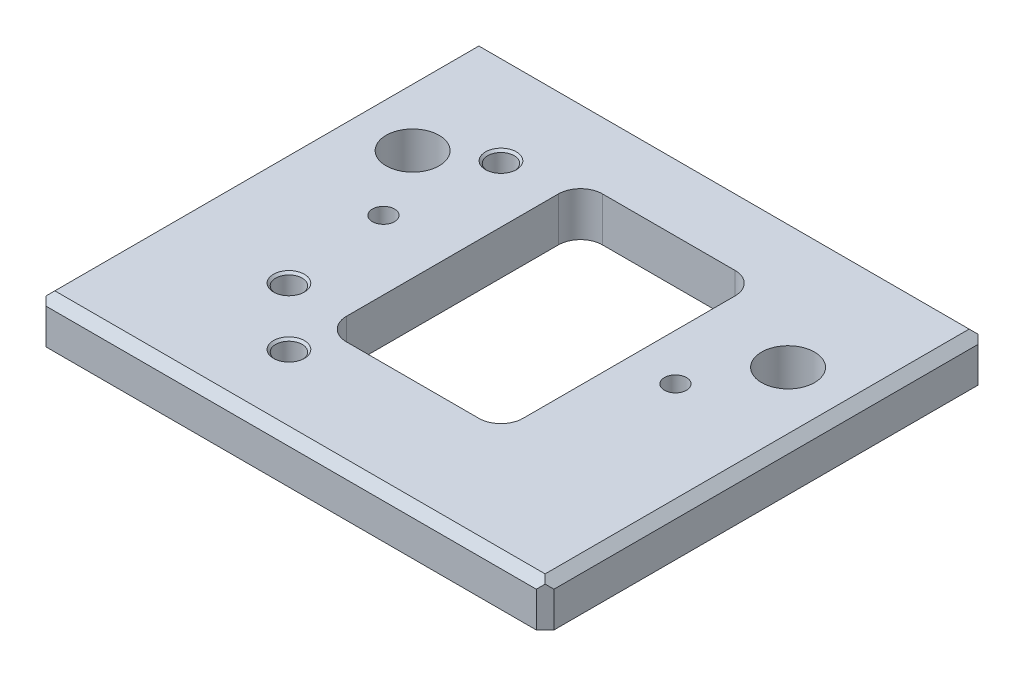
ISO-10303-21;
HEADER;
FILE_DESCRIPTION(('STEP AP214'),'2;1');
FILE_NAME('part.step','',(''),(''),'','','');
FILE_SCHEMA(('AUTOMOTIVE_DESIGN { 1 0 10303 214 1 1 1 1 }'));
ENDSEC;
DATA;
#1=APPLICATION_CONTEXT('core data for automotive mechanical design processes');
#2=APPLICATION_PROTOCOL_DEFINITION('international standard','automotive_design',2000,#1);
#3=PRODUCT_CONTEXT('',#1,'mechanical');
#4=PRODUCT('Part','Part','',(#3));
#5=PRODUCT_RELATED_PRODUCT_CATEGORY('part','',(#4));
#6=PRODUCT_DEFINITION_FORMATION('','',#4);
#7=PRODUCT_DEFINITION_CONTEXT('part definition',#1,'design');
#8=PRODUCT_DEFINITION('design','',#6,#7);
#9=PRODUCT_DEFINITION_SHAPE('','',#8);
#10=(LENGTH_UNIT() NAMED_UNIT(*) SI_UNIT(.MILLI.,.METRE.));
#11=(NAMED_UNIT(*) PLANE_ANGLE_UNIT() SI_UNIT($,.RADIAN.));
#12=(NAMED_UNIT(*) SI_UNIT($,.STERADIAN.) SOLID_ANGLE_UNIT());
#13=UNCERTAINTY_MEASURE_WITH_UNIT(LENGTH_MEASURE(1.E-05),#10,'distance_accuracy_value','');
#14=(GEOMETRIC_REPRESENTATION_CONTEXT(3) GLOBAL_UNCERTAINTY_ASSIGNED_CONTEXT((#13)) GLOBAL_UNIT_ASSIGNED_CONTEXT((#10,
#11,#12)) REPRESENTATION_CONTEXT('',''));
#15=CARTESIAN_POINT('',(0.,0.,0.));
#16=DIRECTION('',(0.,0.,1.));
#17=DIRECTION('',(1.,0.,0.));
#18=AXIS2_PLACEMENT_3D('',#15,#16,#17);
#19=CARTESIAN_POINT('',(0.,0.,0.));
#20=DIRECTION('',(0.,-1.,0.));
#21=DIRECTION('',(0.,0.,-1.));
#22=AXIS2_PLACEMENT_3D('',#19,#20,#21);
#23=PLANE('',#22);
#24=CARTESIAN_POINT('',(70.,0.,-50.));
#25=DIRECTION('',(0.,1.,0.));
#26=DIRECTION('',(0.,0.,1.));
#27=AXIS2_PLACEMENT_3D('',#24,#25,#26);
#28=CIRCLE('',#27,6.);
#29=CARTESIAN_POINT('',(70.,0.,-44.));
#30=VERTEX_POINT('',#29);
#31=EDGE_CURVE('E485',#30,#30,#28,.T.);
#32=ORIENTED_EDGE('',*,*,#31,.F.);
#33=EDGE_LOOP('',(#32));
#34=FACE_BOUND('',#33,.T.);
#35=CARTESIAN_POINT('',(-15.,0.,-50.));
#36=DIRECTION('',(0.,1.,0.));
#37=DIRECTION('',(0.,0.,1.));
#38=AXIS2_PLACEMENT_3D('',#35,#36,#37);
#39=CIRCLE('',#38,6.);
#40=CARTESIAN_POINT('',(-15.,0.,-44.));
#41=VERTEX_POINT('',#40);
#42=EDGE_CURVE('E479',#41,#41,#39,.T.);
#43=ORIENTED_EDGE('',*,*,#42,.F.);
#44=EDGE_LOOP('',(#43));
#45=FACE_BOUND('',#44,.T.);
#46=CARTESIAN_POINT('',(60.5,0.,-34.));
#47=DIRECTION('',(0.,1.,0.));
#48=DIRECTION('',(0.,0.,1.));
#49=AXIS2_PLACEMENT_3D('',#46,#47,#48);
#50=CIRCLE('',#49,2.49999999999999);
#51=CARTESIAN_POINT('',(60.5,0.,-31.5));
#52=VERTEX_POINT('',#51);
#53=EDGE_CURVE('E474',#52,#52,#50,.T.);
#54=ORIENTED_EDGE('',*,*,#53,.F.);
#55=EDGE_LOOP('',(#54));
#56=FACE_BOUND('',#55,.T.);
#57=DIRECTION('',(-1.,0.,0.));
#58=VECTOR('',#57,1.);
#59=CARTESIAN_POINT('',(15.,0.,-63.));
#60=LINE('',#59,#58);
#61=CARTESIAN_POINT('',(45.,0.,-63.));
#62=VERTEX_POINT('',#61);
#63=CARTESIAN_POINT('',(15.,0.,-63.));
#64=VERTEX_POINT('',#63);
#65=EDGE_CURVE('E224',#62,#64,#60,.T.);
#66=ORIENTED_EDGE('',*,*,#65,.F.);
#67=CARTESIAN_POINT('',(45.,0.,-58.));
#68=DIRECTION('',(0.,1.,0.));
#69=DIRECTION('',(0.,0.,-1.));
#70=AXIS2_PLACEMENT_3D('',#67,#68,#69);
#71=CIRCLE('',#70,4.99999999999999);
#72=CARTESIAN_POINT('',(50.,0.,-58.));
#73=VERTEX_POINT('',#72);
#74=EDGE_CURVE('E182',#73,#62,#71,.T.);
#75=ORIENTED_EDGE('',*,*,#74,.F.);
#76=DIRECTION('',(0.,0.,-1.));
#77=VECTOR('',#76,1.);
#78=CARTESIAN_POINT('',(50.,0.,-10.));
#79=LINE('',#78,#77);
#80=CARTESIAN_POINT('',(50.,0.,-10.));
#81=VERTEX_POINT('',#80);
#82=EDGE_CURVE('E201',#81,#73,#79,.T.);
#83=ORIENTED_EDGE('',*,*,#82,.F.);
#84=CARTESIAN_POINT('',(45.,0.,-10.));
#85=DIRECTION('',(0.,1.,0.));
#86=DIRECTION('',(0.,0.,1.));
#87=AXIS2_PLACEMENT_3D('',#84,#85,#86);
#88=CIRCLE('',#87,5.);
#89=CARTESIAN_POINT('',(45.,0.,-5.));
#90=VERTEX_POINT('',#89);
#91=EDGE_CURVE('E204',#90,#81,#88,.T.);
#92=ORIENTED_EDGE('',*,*,#91,.F.);
#93=DIRECTION('',(1.,0.,0.));
#94=VECTOR('',#93,1.);
#95=CARTESIAN_POINT('',(15.,0.,-5.));
#96=LINE('',#95,#94);
#97=CARTESIAN_POINT('',(15.,0.,-5.));
#98=VERTEX_POINT('',#97);
#99=EDGE_CURVE('E236',#98,#90,#96,.T.);
#100=ORIENTED_EDGE('',*,*,#99,.F.);
#101=CARTESIAN_POINT('',(15.,0.,-10.));
#102=DIRECTION('',(0.,1.,0.));
#103=DIRECTION('',(0.,0.,-1.));
#104=AXIS2_PLACEMENT_3D('',#101,#102,#103);
#105=CIRCLE('',#104,5.);
#106=CARTESIAN_POINT('',(10.,0.,-10.));
#107=VERTEX_POINT('',#106);
#108=EDGE_CURVE('E233',#107,#98,#105,.T.);
#109=ORIENTED_EDGE('',*,*,#108,.F.);
#110=DIRECTION('',(0.,0.,1.));
#111=VECTOR('',#110,1.);
#112=CARTESIAN_POINT('',(10.,0.,-10.));
#113=LINE('',#112,#111);
#114=CARTESIAN_POINT('',(10.,0.,-58.));
#115=VERTEX_POINT('',#114);
#116=EDGE_CURVE('E230',#115,#107,#113,.T.);
#117=ORIENTED_EDGE('',*,*,#116,.F.);
#118=CARTESIAN_POINT('',(15.,0.,-58.));
#119=DIRECTION('',(0.,1.,0.));
#120=DIRECTION('',(0.,0.,-1.));
#121=AXIS2_PLACEMENT_3D('',#118,#119,#120);
#122=CIRCLE('',#121,5.);
#123=EDGE_CURVE('E227',#64,#115,#122,.T.);
#124=ORIENTED_EDGE('',*,*,#123,.F.);
#125=EDGE_LOOP('',(#66,#75,#83,#92,#100,#109,#117,#124));
#126=FACE_BOUND('',#125,.T.);
#127=DIRECTION('',(1.,0.,0.));
#128=VECTOR('',#127,1.);
#129=CARTESIAN_POINT('',(83.,0.,18.));
#130=LINE('',#129,#128);
#131=CARTESIAN_POINT('',(-28.,0.,18.));
#132=VERTEX_POINT('',#131);
#133=CARTESIAN_POINT('',(83.,0.,18.));
#134=VERTEX_POINT('',#133);
#135=EDGE_CURVE('E293',#132,#134,#130,.T.);
#136=ORIENTED_EDGE('',*,*,#135,.T.);
#137=DIRECTION('',(0.,0.,-1.));
#138=VECTOR('',#137,1.);
#139=CARTESIAN_POINT('',(83.,0.,-78.));
#140=LINE('',#139,#138);
#141=CARTESIAN_POINT('',(83.,0.,-78.));
#142=VERTEX_POINT('',#141);
#143=EDGE_CURVE('E299',#134,#142,#140,.T.);
#144=ORIENTED_EDGE('',*,*,#143,.T.);
#145=DIRECTION('',(-1.,0.,0.));
#146=VECTOR('',#145,1.);
#147=CARTESIAN_POINT('',(-28.,0.,-78.));
#148=LINE('',#147,#146);
#149=CARTESIAN_POINT('',(-28.,0.,-78.));
#150=VERTEX_POINT('',#149);
#151=EDGE_CURVE('E297',#142,#150,#148,.T.);
#152=ORIENTED_EDGE('',*,*,#151,.T.);
#153=DIRECTION('',(0.,0.,1.));
#154=VECTOR('',#153,1.);
#155=CARTESIAN_POINT('',(-28.,0.,18.));
#156=LINE('',#155,#154);
#157=EDGE_CURVE('E295',#150,#132,#156,.T.);
#158=ORIENTED_EDGE('',*,*,#157,.T.);
#159=EDGE_LOOP('',(#136,#144,#152,#158));
#160=FACE_BOUND('',#159,.T.);
#161=CARTESIAN_POINT('',(-3.,0.,-58.));
#162=DIRECTION('',(0.,-1.,0.));
#163=DIRECTION('',(0.,0.,-1.));
#164=AXIS2_PLACEMENT_3D('',#161,#162,#163);
#165=CIRCLE('',#164,3.50000000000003);
#166=CARTESIAN_POINT('',(-3.,0.,-61.5));
#167=VERTEX_POINT('',#166);
#168=EDGE_CURVE('E362',#167,#167,#165,.T.);
#169=ORIENTED_EDGE('',*,*,#168,.T.);
#170=EDGE_LOOP('',(#169));
#171=FACE_BOUND('',#170,.T.);
#172=CARTESIAN_POINT('',(-3.,0.,-10.));
#173=DIRECTION('',(0.,-1.,0.));
#174=DIRECTION('',(0.,0.,-1.));
#175=AXIS2_PLACEMENT_3D('',#172,#173,#174);
#176=CIRCLE('',#175,3.5);
#177=CARTESIAN_POINT('',(-3.,0.,-13.5));
#178=VERTEX_POINT('',#177);
#179=EDGE_CURVE('E46',#178,#178,#176,.T.);
#180=ORIENTED_EDGE('',*,*,#179,.T.);
#181=EDGE_LOOP('',(#180));
#182=FACE_BOUND('',#181,.T.);
#183=CARTESIAN_POINT('',(10.,0.,3.));
#184=DIRECTION('',(0.,-1.,0.));
#185=DIRECTION('',(0.,0.,-1.));
#186=AXIS2_PLACEMENT_3D('',#183,#184,#185);
#187=CIRCLE('',#186,3.50000000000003);
#188=CARTESIAN_POINT('',(10.,0.,-0.500000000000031));
#189=VERTEX_POINT('',#188);
#190=EDGE_CURVE('E11',#189,#189,#187,.T.);
#191=ORIENTED_EDGE('',*,*,#190,.T.);
#192=EDGE_LOOP('',(#191));
#193=FACE_BOUND('',#192,.T.);
#194=CARTESIAN_POINT('',(-5.6,0.,-34.));
#195=DIRECTION('',(0.,1.,0.));
#196=DIRECTION('',(0.,0.,1.));
#197=AXIS2_PLACEMENT_3D('',#194,#195,#196);
#198=CIRCLE('',#197,2.49999999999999);
#199=CARTESIAN_POINT('',(-5.6,0.,-31.5));
#200=VERTEX_POINT('',#199);
#201=EDGE_CURVE('E470',#200,#200,#198,.T.);
#202=ORIENTED_EDGE('',*,*,#201,.F.);
#203=EDGE_LOOP('',(#202));
#204=FACE_BOUND('',#203,.T.);
#205=ADVANCED_FACE('F37',(#34,#45,#56,#126,#160,#171,#182,#193,#204),#23,.F.);
#206=CARTESIAN_POINT('',(-30.,-10.,20.));
#207=DIRECTION('',(-1.,0.,0.));
#208=DIRECTION('',(0.,0.,1.));
#209=AXIS2_PLACEMENT_3D('',#206,#207,#208);
#210=PLANE('',#209);
#211=DIRECTION('',(0.,1.,0.));
#212=VECTOR('',#211,1.);
#213=CARTESIAN_POINT('',(-30.,-10.,18.));
#214=LINE('',#213,#212);
#215=CARTESIAN_POINT('',(-30.,-10.,18.));
#216=VERTEX_POINT('',#215);
#217=CARTESIAN_POINT('',(-30.,-2.00000000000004,18.));
#218=VERTEX_POINT('',#217);
#219=EDGE_CURVE('E284',#216,#218,#214,.T.);
#220=ORIENTED_EDGE('',*,*,#219,.T.);
#221=DIRECTION('',(0.,0.,-1.));
#222=VECTOR('',#221,1.);
#223=CARTESIAN_POINT('',(-30.,-2.00000000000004,-78.));
#224=LINE('',#223,#222);
#225=CARTESIAN_POINT('',(-30.,-2.00000000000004,-78.));
#226=VERTEX_POINT('',#225);
#227=EDGE_CURVE('E321',#218,#226,#224,.T.);
#228=ORIENTED_EDGE('',*,*,#227,.T.);
#229=DIRECTION('',(0.,-1.,0.));
#230=VECTOR('',#229,1.);
#231=CARTESIAN_POINT('',(-30.,-10.,-78.));
#232=LINE('',#231,#230);
#233=CARTESIAN_POINT('',(-30.,-10.,-78.));
#234=VERTEX_POINT('',#233);
#235=EDGE_CURVE('E286',#226,#234,#232,.T.);
#236=ORIENTED_EDGE('',*,*,#235,.T.);
#237=DIRECTION('',(0.,0.,1.));
#238=VECTOR('',#237,1.);
#239=CARTESIAN_POINT('',(-30.,-10.,20.));
#240=LINE('',#239,#238);
#241=EDGE_CURVE('E243',#234,#216,#240,.T.);
#242=ORIENTED_EDGE('',*,*,#241,.T.);
#243=EDGE_LOOP('',(#220,#228,#236,#242));
#244=FACE_BOUND('',#243,.T.);
#245=ADVANCED_FACE('F393',(#244),#210,.T.);
#246=CARTESIAN_POINT('',(-30.,-10.,-80.));
#247=DIRECTION('',(0.,0.,-1.));
#248=DIRECTION('',(-1.,0.,0.));
#249=AXIS2_PLACEMENT_3D('',#246,#247,#248);
#250=PLANE('',#249);
#251=DIRECTION('',(0.,1.,0.));
#252=VECTOR('',#251,1.);
#253=CARTESIAN_POINT('',(-28.,-10.,-80.));
#254=LINE('',#253,#252);
#255=CARTESIAN_POINT('',(-28.,-10.,-80.));
#256=VERTEX_POINT('',#255);
#257=CARTESIAN_POINT('',(-28.,-2.00000000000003,-80.));
#258=VERTEX_POINT('',#257);
#259=EDGE_CURVE('E271',#256,#258,#254,.T.);
#260=ORIENTED_EDGE('',*,*,#259,.T.);
#261=DIRECTION('',(1.,0.,0.));
#262=VECTOR('',#261,1.);
#263=CARTESIAN_POINT('',(83.,-2.00000000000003,-80.));
#264=LINE('',#263,#262);
#265=CARTESIAN_POINT('',(83.,-2.00000000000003,-80.));
#266=VERTEX_POINT('',#265);
#267=EDGE_CURVE('E317',#258,#266,#264,.T.);
#268=ORIENTED_EDGE('',*,*,#267,.T.);
#269=DIRECTION('',(0.,-1.,0.));
#270=VECTOR('',#269,1.);
#271=CARTESIAN_POINT('',(83.,-10.,-80.));
#272=LINE('',#271,#270);
#273=CARTESIAN_POINT('',(83.,-10.,-80.));
#274=VERTEX_POINT('',#273);
#275=EDGE_CURVE('E274',#266,#274,#272,.T.);
#276=ORIENTED_EDGE('',*,*,#275,.T.);
#277=DIRECTION('',(-1.,0.,0.));
#278=VECTOR('',#277,1.);
#279=CARTESIAN_POINT('',(-30.,-10.,-80.));
#280=LINE('',#279,#278);
#281=EDGE_CURVE('E263',#274,#256,#280,.T.);
#282=ORIENTED_EDGE('',*,*,#281,.T.);
#283=EDGE_LOOP('',(#260,#268,#276,#282));
#284=FACE_BOUND('',#283,.T.);
#285=ADVANCED_FACE('F399',(#284),#250,.T.);
#286=CARTESIAN_POINT('',(85.,-10.,20.));
#287=DIRECTION('',(1.,0.,0.));
#288=DIRECTION('',(0.,0.,-1.));
#289=AXIS2_PLACEMENT_3D('',#286,#287,#288);
#290=PLANE('',#289);
#291=DIRECTION('',(0.,1.,0.));
#292=VECTOR('',#291,1.);
#293=CARTESIAN_POINT('',(85.,-10.,-78.));
#294=LINE('',#293,#292);
#295=CARTESIAN_POINT('',(85.,-10.,-78.));
#296=VERTEX_POINT('',#295);
#297=CARTESIAN_POINT('',(85.,-2.00000000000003,-78.));
#298=VERTEX_POINT('',#297);
#299=EDGE_CURVE('E268',#296,#298,#294,.T.);
#300=ORIENTED_EDGE('',*,*,#299,.T.);
#301=DIRECTION('',(0.,0.,1.));
#302=VECTOR('',#301,1.);
#303=CARTESIAN_POINT('',(85.,-2.00000000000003,18.));
#304=LINE('',#303,#302);
#305=CARTESIAN_POINT('',(85.,-2.00000000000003,18.));
#306=VERTEX_POINT('',#305);
#307=EDGE_CURVE('E306',#298,#306,#304,.T.);
#308=ORIENTED_EDGE('',*,*,#307,.T.);
#309=DIRECTION('',(0.,-1.,0.));
#310=VECTOR('',#309,1.);
#311=CARTESIAN_POINT('',(85.,-10.,18.));
#312=LINE('',#311,#310);
#313=CARTESIAN_POINT('',(85.,-10.,18.));
#314=VERTEX_POINT('',#313);
#315=EDGE_CURVE('E266',#306,#314,#312,.T.);
#316=ORIENTED_EDGE('',*,*,#315,.T.);
#317=DIRECTION('',(0.,0.,-1.));
#318=VECTOR('',#317,1.);
#319=CARTESIAN_POINT('',(85.,-10.,20.));
#320=LINE('',#319,#318);
#321=EDGE_CURVE('E260',#314,#296,#320,.T.);
#322=ORIENTED_EDGE('',*,*,#321,.T.);
#323=EDGE_LOOP('',(#300,#308,#316,#322));
#324=FACE_BOUND('',#323,.T.);
#325=ADVANCED_FACE('F409',(#324),#290,.T.);
#326=CARTESIAN_POINT('',(-30.,-10.,20.));
#327=DIRECTION('',(0.,0.,1.));
#328=DIRECTION('',(1.,0.,0.));
#329=AXIS2_PLACEMENT_3D('',#326,#327,#328);
#330=PLANE('',#329);
#331=DIRECTION('',(0.,1.,0.));
#332=VECTOR('',#331,1.);
#333=CARTESIAN_POINT('',(83.,-10.,20.));
#334=LINE('',#333,#332);
#335=CARTESIAN_POINT('',(83.,-10.,20.));
#336=VERTEX_POINT('',#335);
#337=CARTESIAN_POINT('',(83.,-2.00000000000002,20.));
#338=VERTEX_POINT('',#337);
#339=EDGE_CURVE('E290',#336,#338,#334,.T.);
#340=ORIENTED_EDGE('',*,*,#339,.T.);
#341=DIRECTION('',(-1.,0.,0.));
#342=VECTOR('',#341,1.);
#343=CARTESIAN_POINT('',(-28.,-2.00000000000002,20.));
#344=LINE('',#343,#342);
#345=CARTESIAN_POINT('',(-28.,-2.00000000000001,20.));
#346=VERTEX_POINT('',#345);
#347=EDGE_CURVE('E323',#338,#346,#344,.T.);
#348=ORIENTED_EDGE('',*,*,#347,.T.);
#349=DIRECTION('',(0.,-1.,0.));
#350=VECTOR('',#349,1.);
#351=CARTESIAN_POINT('',(-28.,-10.,20.));
#352=LINE('',#351,#350);
#353=CARTESIAN_POINT('',(-28.,-10.,20.));
#354=VERTEX_POINT('',#353);
#355=EDGE_CURVE('E288',#346,#354,#352,.T.);
#356=ORIENTED_EDGE('',*,*,#355,.T.);
#357=DIRECTION('',(1.,0.,0.));
#358=VECTOR('',#357,1.);
#359=CARTESIAN_POINT('',(-30.,-10.,20.));
#360=LINE('',#359,#358);
#361=EDGE_CURVE('E257',#354,#336,#360,.T.);
#362=ORIENTED_EDGE('',*,*,#361,.T.);
#363=EDGE_LOOP('',(#340,#348,#356,#362));
#364=FACE_BOUND('',#363,.T.);
#365=ADVANCED_FACE('F413',(#364),#330,.T.);
#366=CARTESIAN_POINT('',(0.,-10.,0.));
#367=DIRECTION('',(0.,-1.,0.));
#368=DIRECTION('',(0.,0.,-1.));
#369=AXIS2_PLACEMENT_3D('',#366,#367,#368);
#370=PLANE('',#369);
#371=CARTESIAN_POINT('',(70.,-10.,-50.));
#372=DIRECTION('',(0.,1.,0.));
#373=DIRECTION('',(0.,0.,1.));
#374=AXIS2_PLACEMENT_3D('',#371,#372,#373);
#375=CIRCLE('',#374,6.);
#376=CARTESIAN_POINT('',(70.,-10.,-44.));
#377=VERTEX_POINT('',#376);
#378=EDGE_CURVE('E482',#377,#377,#375,.T.);
#379=ORIENTED_EDGE('',*,*,#378,.T.);
#380=EDGE_LOOP('',(#379));
#381=FACE_BOUND('',#380,.T.);
#382=CARTESIAN_POINT('',(-15.,-10.,-50.));
#383=DIRECTION('',(0.,1.,0.));
#384=DIRECTION('',(0.,0.,1.));
#385=AXIS2_PLACEMENT_3D('',#382,#383,#384);
#386=CIRCLE('',#385,6.);
#387=CARTESIAN_POINT('',(-15.,-10.,-44.));
#388=VERTEX_POINT('',#387);
#389=EDGE_CURVE('E478',#388,#388,#386,.T.);
#390=ORIENTED_EDGE('',*,*,#389,.T.);
#391=EDGE_LOOP('',(#390));
#392=FACE_BOUND('',#391,.T.);
#393=CARTESIAN_POINT('',(60.5,-10.,-34.));
#394=DIRECTION('',(0.,-1.,0.));
#395=DIRECTION('',(0.,0.,-1.));
#396=AXIS2_PLACEMENT_3D('',#393,#394,#395);
#397=CIRCLE('',#396,2.49999999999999);
#398=CARTESIAN_POINT('',(60.5,-10.,-36.5));
#399=VERTEX_POINT('',#398);
#400=EDGE_CURVE('E41',#399,#399,#397,.T.);
#401=ORIENTED_EDGE('',*,*,#400,.F.);
#402=EDGE_LOOP('',(#401));
#403=FACE_BOUND('',#402,.T.);
#404=CARTESIAN_POINT('',(-5.6,-10.,-34.));
#405=DIRECTION('',(0.,1.,0.));
#406=DIRECTION('',(0.,0.,1.));
#407=AXIS2_PLACEMENT_3D('',#404,#405,#406);
#408=CIRCLE('',#407,2.5);
#409=CARTESIAN_POINT('',(-5.6,-10.,-31.5));
#410=VERTEX_POINT('',#409);
#411=EDGE_CURVE('E207',#410,#410,#408,.T.);
#412=ORIENTED_EDGE('',*,*,#411,.T.);
#413=EDGE_LOOP('',(#412));
#414=FACE_BOUND('',#413,.T.);
#415=CARTESIAN_POINT('',(10.,-10.,3.));
#416=DIRECTION('',(0.,-1.,0.));
#417=DIRECTION('',(0.,0.,-1.));
#418=AXIS2_PLACEMENT_3D('',#415,#416,#417);
#419=CIRCLE('',#418,3.49999999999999);
#420=CARTESIAN_POINT('',(10.,-10.,-0.499999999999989));
#421=VERTEX_POINT('',#420);
#422=EDGE_CURVE('E341',#421,#421,#419,.F.);
#423=ORIENTED_EDGE('',*,*,#422,.T.);
#424=EDGE_LOOP('',(#423));
#425=FACE_BOUND('',#424,.T.);
#426=CARTESIAN_POINT('',(-3.,-10.,-10.));
#427=DIRECTION('',(0.,-1.,0.));
#428=DIRECTION('',(0.,0.,-1.));
#429=AXIS2_PLACEMENT_3D('',#426,#427,#428);
#430=CIRCLE('',#429,3.5);
#431=CARTESIAN_POINT('',(-3.,-10.,-13.5));
#432=VERTEX_POINT('',#431);
#433=EDGE_CURVE('E338',#432,#432,#430,.F.);
#434=ORIENTED_EDGE('',*,*,#433,.T.);
#435=EDGE_LOOP('',(#434));
#436=FACE_BOUND('',#435,.T.);
#437=CARTESIAN_POINT('',(-3.,-10.,-58.));
#438=DIRECTION('',(0.,-1.,0.));
#439=DIRECTION('',(0.,0.,-1.));
#440=AXIS2_PLACEMENT_3D('',#437,#438,#439);
#441=CIRCLE('',#440,3.49999999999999);
#442=CARTESIAN_POINT('',(-3.,-10.,-61.5));
#443=VERTEX_POINT('',#442);
#444=EDGE_CURVE('E325',#443,#443,#441,.F.);
#445=ORIENTED_EDGE('',*,*,#444,.T.);
#446=EDGE_LOOP('',(#445));
#447=FACE_BOUND('',#446,.T.);
#448=CARTESIAN_POINT('',(45.,-10.,-58.));
#449=DIRECTION('',(0.,1.,0.));
#450=DIRECTION('',(0.,0.,-1.));
#451=AXIS2_PLACEMENT_3D('',#448,#449,#450);
#452=CIRCLE('',#451,4.99999999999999);
#453=CARTESIAN_POINT('',(50.,-10.,-58.));
#454=VERTEX_POINT('',#453);
#455=CARTESIAN_POINT('',(45.,-10.,-63.));
#456=VERTEX_POINT('',#455);
#457=EDGE_CURVE('E179',#454,#456,#452,.T.);
#458=ORIENTED_EDGE('',*,*,#457,.T.);
#459=DIRECTION('',(-1.,0.,0.));
#460=VECTOR('',#459,1.);
#461=CARTESIAN_POINT('',(15.,-10.,-63.));
#462=LINE('',#461,#460);
#463=CARTESIAN_POINT('',(15.,-10.,-63.));
#464=VERTEX_POINT('',#463);
#465=EDGE_CURVE('E191',#456,#464,#462,.T.);
#466=ORIENTED_EDGE('',*,*,#465,.T.);
#467=CARTESIAN_POINT('',(15.,-10.,-58.));
#468=DIRECTION('',(0.,1.,0.));
#469=DIRECTION('',(0.,0.,-1.));
#470=AXIS2_PLACEMENT_3D('',#467,#468,#469);
#471=CIRCLE('',#470,5.);
#472=CARTESIAN_POINT('',(10.,-10.,-58.));
#473=VERTEX_POINT('',#472);
#474=EDGE_CURVE('E195',#464,#473,#471,.T.);
#475=ORIENTED_EDGE('',*,*,#474,.T.);
#476=DIRECTION('',(0.,0.,1.));
#477=VECTOR('',#476,1.);
#478=CARTESIAN_POINT('',(10.,-10.,-10.));
#479=LINE('',#478,#477);
#480=CARTESIAN_POINT('',(10.,-10.,-10.));
#481=VERTEX_POINT('',#480);
#482=EDGE_CURVE('E211',#473,#481,#479,.T.);
#483=ORIENTED_EDGE('',*,*,#482,.T.);
#484=CARTESIAN_POINT('',(15.,-10.,-10.));
#485=DIRECTION('',(0.,1.,0.));
#486=DIRECTION('',(0.,0.,-1.));
#487=AXIS2_PLACEMENT_3D('',#484,#485,#486);
#488=CIRCLE('',#487,5.);
#489=CARTESIAN_POINT('',(15.,-10.,-5.));
#490=VERTEX_POINT('',#489);
#491=EDGE_CURVE('E214',#481,#490,#488,.T.);
#492=ORIENTED_EDGE('',*,*,#491,.T.);
#493=DIRECTION('',(1.,0.,0.));
#494=VECTOR('',#493,1.);
#495=CARTESIAN_POINT('',(15.,-10.,-5.));
#496=LINE('',#495,#494);
#497=CARTESIAN_POINT('',(45.,-10.,-5.));
#498=VERTEX_POINT('',#497);
#499=EDGE_CURVE('E217',#490,#498,#496,.T.);
#500=ORIENTED_EDGE('',*,*,#499,.T.);
#501=CARTESIAN_POINT('',(45.,-10.,-10.));
#502=DIRECTION('',(0.,1.,0.));
#503=DIRECTION('',(0.,0.,1.));
#504=AXIS2_PLACEMENT_3D('',#501,#502,#503);
#505=CIRCLE('',#504,5.);
#506=CARTESIAN_POINT('',(50.,-10.,-10.));
#507=VERTEX_POINT('',#506);
#508=EDGE_CURVE('E220',#498,#507,#505,.T.);
#509=ORIENTED_EDGE('',*,*,#508,.T.);
#510=DIRECTION('',(0.,0.,-1.));
#511=VECTOR('',#510,1.);
#512=CARTESIAN_POINT('',(50.,-10.,-10.));
#513=LINE('',#512,#511);
#514=EDGE_CURVE('E187',#507,#454,#513,.T.);
#515=ORIENTED_EDGE('',*,*,#514,.T.);
#516=EDGE_LOOP('',(#458,#466,#475,#483,#492,#500,#509,#515));
#517=FACE_BOUND('',#516,.T.);
#518=ORIENTED_EDGE('',*,*,#281,.F.);
#519=DIRECTION('',(-0.70710678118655,0.,-0.707106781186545));
#520=VECTOR('',#519,1.);
#521=CARTESIAN_POINT('',(81.4999999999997,-10.,-81.5000000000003));
#522=LINE('',#521,#520);
#523=EDGE_CURVE('E282',#274,#296,#522,.F.);
#524=ORIENTED_EDGE('',*,*,#523,.T.);
#525=ORIENTED_EDGE('',*,*,#321,.F.);
#526=DIRECTION('',(0.707106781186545,0.,-0.70710678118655));
#527=VECTOR('',#526,1.);
#528=CARTESIAN_POINT('',(51.5000000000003,-10.,51.4999999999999));
#529=LINE('',#528,#527);
#530=EDGE_CURVE('E278',#314,#336,#529,.F.);
#531=ORIENTED_EDGE('',*,*,#530,.T.);
#532=ORIENTED_EDGE('',*,*,#361,.F.);
#533=DIRECTION('',(0.70710678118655,0.,0.707106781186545));
#534=VECTOR('',#533,1.);
#535=CARTESIAN_POINT('',(-23.9999999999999,-10.,24.0000000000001));
#536=LINE('',#535,#534);
#537=EDGE_CURVE('E276',#354,#216,#536,.F.);
#538=ORIENTED_EDGE('',*,*,#537,.T.);
#539=ORIENTED_EDGE('',*,*,#241,.F.);
#540=DIRECTION('',(-0.707106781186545,0.,0.70710678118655));
#541=VECTOR('',#540,1.);
#542=CARTESIAN_POINT('',(-54.0000000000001,-10.,-53.9999999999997));
#543=LINE('',#542,#541);
#544=EDGE_CURVE('E280',#234,#256,#543,.F.);
#545=ORIENTED_EDGE('',*,*,#544,.T.);
#546=EDGE_LOOP('',(#518,#524,#525,#531,#532,#538,#539,#545));
#547=FACE_BOUND('',#546,.T.);
#548=ADVANCED_FACE('F197',(#381,#392,#403,#414,#425,#436,#447,#517,#547),#370,.T.);
#549=CARTESIAN_POINT('',(45.,-10.,-58.));
#550=DIRECTION('',(0.,1.,0.));
#551=DIRECTION('',(0.,0.,1.));
#552=AXIS2_PLACEMENT_3D('',#549,#550,#551);
#553=CYLINDRICAL_SURFACE('',#552,4.99999999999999);
#554=ORIENTED_EDGE('',*,*,#74,.T.);
#555=DIRECTION('',(0.,1.,0.));
#556=VECTOR('',#555,1.);
#557=CARTESIAN_POINT('',(45.,-10.,-63.));
#558=LINE('',#557,#556);
#559=EDGE_CURVE('E175',#456,#62,#558,.T.);
#560=ORIENTED_EDGE('',*,*,#559,.F.);
#561=ORIENTED_EDGE('',*,*,#457,.F.);
#562=DIRECTION('',(0.,1.,0.));
#563=VECTOR('',#562,1.);
#564=CARTESIAN_POINT('',(50.,-10.,-58.));
#565=LINE('',#564,#563);
#566=EDGE_CURVE('E241',#454,#73,#565,.T.);
#567=ORIENTED_EDGE('',*,*,#566,.T.);
#568=EDGE_LOOP('',(#554,#560,#561,#567));
#569=FACE_BOUND('',#568,.T.);
#570=ADVANCED_FACE('F177',(#569),#553,.F.);
#571=CARTESIAN_POINT('',(50.,-10.,-10.));
#572=DIRECTION('',(1.,0.,0.));
#573=DIRECTION('',(0.,0.,-1.));
#574=AXIS2_PLACEMENT_3D('',#571,#572,#573);
#575=PLANE('',#574);
#576=ORIENTED_EDGE('',*,*,#82,.T.);
#577=ORIENTED_EDGE('',*,*,#566,.F.);
#578=ORIENTED_EDGE('',*,*,#514,.F.);
#579=DIRECTION('',(0.,1.,0.));
#580=VECTOR('',#579,1.);
#581=CARTESIAN_POINT('',(50.,-10.,-10.));
#582=LINE('',#581,#580);
#583=EDGE_CURVE('E244',#507,#81,#582,.T.);
#584=ORIENTED_EDGE('',*,*,#583,.T.);
#585=EDGE_LOOP('',(#576,#577,#578,#584));
#586=FACE_BOUND('',#585,.T.);
#587=ADVANCED_FACE('F530',(#586),#575,.F.);
#588=CARTESIAN_POINT('',(45.,-10.,-10.));
#589=DIRECTION('',(0.,1.,0.));
#590=DIRECTION('',(0.,0.,1.));
#591=AXIS2_PLACEMENT_3D('',#588,#589,#590);
#592=CYLINDRICAL_SURFACE('',#591,5.);
#593=ORIENTED_EDGE('',*,*,#91,.T.);
#594=ORIENTED_EDGE('',*,*,#583,.F.);
#595=ORIENTED_EDGE('',*,*,#508,.F.);
#596=DIRECTION('',(0.,1.,0.));
#597=VECTOR('',#596,1.);
#598=CARTESIAN_POINT('',(45.,-10.,-5.));
#599=LINE('',#598,#597);
#600=EDGE_CURVE('E246',#498,#90,#599,.T.);
#601=ORIENTED_EDGE('',*,*,#600,.T.);
#602=EDGE_LOOP('',(#593,#594,#595,#601));
#603=FACE_BOUND('',#602,.T.);
#604=ADVANCED_FACE('F534',(#603),#592,.F.);
#605=CARTESIAN_POINT('',(15.,-10.,-5.));
#606=DIRECTION('',(0.,0.,1.));
#607=DIRECTION('',(1.,0.,0.));
#608=AXIS2_PLACEMENT_3D('',#605,#606,#607);
#609=PLANE('',#608);
#610=ORIENTED_EDGE('',*,*,#99,.T.);
#611=ORIENTED_EDGE('',*,*,#600,.F.);
#612=ORIENTED_EDGE('',*,*,#499,.F.);
#613=DIRECTION('',(0.,1.,0.));
#614=VECTOR('',#613,1.);
#615=CARTESIAN_POINT('',(15.,-10.,-5.));
#616=LINE('',#615,#614);
#617=EDGE_CURVE('E248',#490,#98,#616,.T.);
#618=ORIENTED_EDGE('',*,*,#617,.T.);
#619=EDGE_LOOP('',(#610,#611,#612,#618));
#620=FACE_BOUND('',#619,.T.);
#621=ADVANCED_FACE('F551',(#620),#609,.F.);
#622=CARTESIAN_POINT('',(15.,-10.,-10.));
#623=DIRECTION('',(0.,1.,0.));
#624=DIRECTION('',(0.,0.,1.));
#625=AXIS2_PLACEMENT_3D('',#622,#623,#624);
#626=CYLINDRICAL_SURFACE('',#625,5.);
#627=ORIENTED_EDGE('',*,*,#108,.T.);
#628=ORIENTED_EDGE('',*,*,#617,.F.);
#629=ORIENTED_EDGE('',*,*,#491,.F.);
#630=DIRECTION('',(0.,1.,0.));
#631=VECTOR('',#630,1.);
#632=CARTESIAN_POINT('',(10.,-10.,-10.));
#633=LINE('',#632,#631);
#634=EDGE_CURVE('E250',#481,#107,#633,.T.);
#635=ORIENTED_EDGE('',*,*,#634,.T.);
#636=EDGE_LOOP('',(#627,#628,#629,#635));
#637=FACE_BOUND('',#636,.T.);
#638=ADVANCED_FACE('F547',(#637),#626,.F.);
#639=CARTESIAN_POINT('',(10.,-10.,-10.));
#640=DIRECTION('',(-1.,0.,0.));
#641=DIRECTION('',(0.,0.,1.));
#642=AXIS2_PLACEMENT_3D('',#639,#640,#641);
#643=PLANE('',#642);
#644=ORIENTED_EDGE('',*,*,#116,.T.);
#645=ORIENTED_EDGE('',*,*,#634,.F.);
#646=ORIENTED_EDGE('',*,*,#482,.F.);
#647=DIRECTION('',(0.,1.,0.));
#648=VECTOR('',#647,1.);
#649=CARTESIAN_POINT('',(10.,-10.,-58.));
#650=LINE('',#649,#648);
#651=EDGE_CURVE('E252',#473,#115,#650,.T.);
#652=ORIENTED_EDGE('',*,*,#651,.T.);
#653=EDGE_LOOP('',(#644,#645,#646,#652));
#654=FACE_BOUND('',#653,.T.);
#655=ADVANCED_FACE('F543',(#654),#643,.F.);
#656=CARTESIAN_POINT('',(15.,-10.,-58.));
#657=DIRECTION('',(0.,1.,0.));
#658=DIRECTION('',(0.,0.,1.));
#659=AXIS2_PLACEMENT_3D('',#656,#657,#658);
#660=CYLINDRICAL_SURFACE('',#659,5.);
#661=ORIENTED_EDGE('',*,*,#123,.T.);
#662=ORIENTED_EDGE('',*,*,#651,.F.);
#663=ORIENTED_EDGE('',*,*,#474,.F.);
#664=DIRECTION('',(0.,1.,0.));
#665=VECTOR('',#664,1.);
#666=CARTESIAN_POINT('',(15.,-10.,-63.));
#667=LINE('',#666,#665);
#668=EDGE_CURVE('E186',#464,#64,#667,.T.);
#669=ORIENTED_EDGE('',*,*,#668,.T.);
#670=EDGE_LOOP('',(#661,#662,#663,#669));
#671=FACE_BOUND('',#670,.T.);
#672=ADVANCED_FACE('F540',(#671),#660,.F.);
#673=CARTESIAN_POINT('',(15.,-10.,-63.));
#674=DIRECTION('',(0.,0.,-1.));
#675=DIRECTION('',(-1.,0.,0.));
#676=AXIS2_PLACEMENT_3D('',#673,#674,#675);
#677=PLANE('',#676);
#678=ORIENTED_EDGE('',*,*,#65,.T.);
#679=ORIENTED_EDGE('',*,*,#668,.F.);
#680=ORIENTED_EDGE('',*,*,#465,.F.);
#681=ORIENTED_EDGE('',*,*,#559,.T.);
#682=EDGE_LOOP('',(#678,#679,#680,#681));
#683=FACE_BOUND('',#682,.T.);
#684=ADVANCED_FACE('F192',(#683),#677,.F.);
#685=CARTESIAN_POINT('',(85.,-10.,-78.));
#686=DIRECTION('',(-0.707106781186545,0.,0.70710678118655));
#687=DIRECTION('',(0.,1.,0.));
#688=AXIS2_PLACEMENT_3D('',#685,#686,#687);
#689=PLANE('',#688);
#690=DIRECTION('',(-0.577350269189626,-0.57735026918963,-0.577350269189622));
#691=VECTOR('',#690,1.);
#692=CARTESIAN_POINT('',(81.6666666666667,-3.33333333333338,-81.3333333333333));
#693=LINE('',#692,#691);
#694=CARTESIAN_POINT('',(84.,-1.00000000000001,-79.));
#695=VERTEX_POINT('',#694);
#696=EDGE_CURVE('E302',#266,#695,#693,.F.);
#697=ORIENTED_EDGE('',*,*,#696,.T.);
#698=DIRECTION('',(-0.577350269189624,0.577350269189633,-0.57735026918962));
#699=VECTOR('',#698,1.);
#700=CARTESIAN_POINT('',(87.6666666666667,-4.66666666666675,-75.3333333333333));
#701=LINE('',#700,#699);
#702=EDGE_CURVE('E304',#695,#298,#701,.F.);
#703=ORIENTED_EDGE('',*,*,#702,.T.);
#704=ORIENTED_EDGE('',*,*,#299,.F.);
#705=ORIENTED_EDGE('',*,*,#523,.F.);
#706=ORIENTED_EDGE('',*,*,#275,.F.);
#707=EDGE_LOOP('',(#697,#703,#704,#705,#706));
#708=FACE_BOUND('',#707,.T.);
#709=ADVANCED_FACE('F418',(#708),#689,.F.);
#710=CARTESIAN_POINT('',(-28.,-10.,-80.));
#711=DIRECTION('',(0.70710678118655,0.,0.707106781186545));
#712=DIRECTION('',(0.,1.,0.));
#713=AXIS2_PLACEMENT_3D('',#710,#711,#712);
#714=PLANE('',#713);
#715=DIRECTION('',(-0.577350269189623,-0.577350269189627,0.577350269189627));
#716=VECTOR('',#715,1.);
#717=CARTESIAN_POINT('',(-31.3333333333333,-3.33333333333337,-76.6666666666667));
#718=LINE('',#717,#716);
#719=CARTESIAN_POINT('',(-29.,-1.00000000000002,-79.));
#720=VERTEX_POINT('',#719);
#721=EDGE_CURVE('E313',#226,#720,#718,.F.);
#722=ORIENTED_EDGE('',*,*,#721,.T.);
#723=DIRECTION('',(-0.57735026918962,0.577350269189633,0.577350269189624));
#724=VECTOR('',#723,1.);
#725=CARTESIAN_POINT('',(-25.3333333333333,-4.66666666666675,-82.6666666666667));
#726=LINE('',#725,#724);
#727=EDGE_CURVE('E315',#720,#258,#726,.F.);
#728=ORIENTED_EDGE('',*,*,#727,.T.);
#729=ORIENTED_EDGE('',*,*,#259,.F.);
#730=ORIENTED_EDGE('',*,*,#544,.F.);
#731=ORIENTED_EDGE('',*,*,#235,.F.);
#732=EDGE_LOOP('',(#722,#728,#729,#730,#731));
#733=FACE_BOUND('',#732,.T.);
#734=ADVANCED_FACE('F421',(#733),#714,.F.);
#735=CARTESIAN_POINT('',(83.,-10.,20.));
#736=DIRECTION('',(-0.70710678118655,0.,-0.707106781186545));
#737=DIRECTION('',(0.,1.,0.));
#738=AXIS2_PLACEMENT_3D('',#735,#736,#737);
#739=PLANE('',#738);
#740=ORIENTED_EDGE('',*,*,#315,.F.);
#741=DIRECTION('',(0.577350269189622,-0.57735026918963,-0.577350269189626));
#742=VECTOR('',#741,1.);
#743=CARTESIAN_POINT('',(86.3333333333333,-3.33333333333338,16.6666666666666));
#744=LINE('',#743,#742);
#745=CARTESIAN_POINT('',(84.,-1.00000000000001,19.));
#746=VERTEX_POINT('',#745);
#747=EDGE_CURVE('E311',#306,#746,#744,.F.);
#748=ORIENTED_EDGE('',*,*,#747,.T.);
#749=DIRECTION('',(0.577350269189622,0.57735026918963,-0.577350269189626));
#750=VECTOR('',#749,1.);
#751=CARTESIAN_POINT('',(80.3333333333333,-4.66666666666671,22.6666666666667));
#752=LINE('',#751,#750);
#753=EDGE_CURVE('E309',#746,#338,#752,.F.);
#754=ORIENTED_EDGE('',*,*,#753,.T.);
#755=ORIENTED_EDGE('',*,*,#339,.F.);
#756=ORIENTED_EDGE('',*,*,#530,.F.);
#757=EDGE_LOOP('',(#740,#748,#754,#755,#756));
#758=FACE_BOUND('',#757,.T.);
#759=ADVANCED_FACE('F425',(#758),#739,.F.);
#760=CARTESIAN_POINT('',(-30.,-10.,18.));
#761=DIRECTION('',(0.707106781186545,0.,-0.70710678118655));
#762=DIRECTION('',(0.,1.,0.));
#763=AXIS2_PLACEMENT_3D('',#760,#761,#762);
#764=PLANE('',#763);
#765=DIRECTION('',(0.577350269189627,-0.577350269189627,0.577350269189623));
#766=VECTOR('',#765,1.);
#767=CARTESIAN_POINT('',(-26.6666666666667,-3.33333333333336,21.3333333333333));
#768=LINE('',#767,#766);
#769=CARTESIAN_POINT('',(-29.,-1.00000000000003,19.));
#770=VERTEX_POINT('',#769);
#771=EDGE_CURVE('E53',#346,#770,#768,.F.);
#772=ORIENTED_EDGE('',*,*,#771,.T.);
#773=DIRECTION('',(0.577350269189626,0.57735026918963,0.577350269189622));
#774=VECTOR('',#773,1.);
#775=CARTESIAN_POINT('',(-32.6666666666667,-4.66666666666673,15.3333333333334));
#776=LINE('',#775,#774);
#777=EDGE_CURVE('E57',#770,#218,#776,.F.);
#778=ORIENTED_EDGE('',*,*,#777,.T.);
#779=ORIENTED_EDGE('',*,*,#219,.F.);
#780=ORIENTED_EDGE('',*,*,#537,.F.);
#781=ORIENTED_EDGE('',*,*,#355,.F.);
#782=EDGE_LOOP('',(#772,#778,#779,#780,#781));
#783=FACE_BOUND('',#782,.T.);
#784=ADVANCED_FACE('F429',(#783),#764,.F.);
#785=CARTESIAN_POINT('',(-28.,0.,0.));
#786=DIRECTION('',(-0.70710678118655,0.707106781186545,0.));
#787=DIRECTION('',(0.,0.,-1.));
#788=AXIS2_PLACEMENT_3D('',#785,#786,#787);
#789=PLANE('',#788);
#790=ORIENTED_EDGE('',*,*,#227,.F.);
#791=ORIENTED_EDGE('',*,*,#777,.F.);
#792=DIRECTION('',(-0.577350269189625,-0.577350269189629,0.577350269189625));
#793=VECTOR('',#792,1.);
#794=CARTESIAN_POINT('',(-18.6666666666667,9.33333333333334,8.66666666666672));
#795=LINE('',#794,#793);
#796=EDGE_CURVE('E225',#132,#770,#795,.T.);
#797=ORIENTED_EDGE('',*,*,#796,.F.);
#798=ORIENTED_EDGE('',*,*,#157,.F.);
#799=DIRECTION('',(-0.577350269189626,-0.57735026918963,-0.577350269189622));
#800=VECTOR('',#799,1.);
#801=CARTESIAN_POINT('',(-2.00000000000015,26.,-52.0000000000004));
#802=LINE('',#801,#800);
#803=EDGE_CURVE('E331',#720,#150,#802,.F.);
#804=ORIENTED_EDGE('',*,*,#803,.F.);
#805=ORIENTED_EDGE('',*,*,#721,.F.);
#806=EDGE_LOOP('',(#790,#791,#797,#798,#804,#805));
#807=FACE_BOUND('',#806,.T.);
#808=ADVANCED_FACE('F433',(#807),#789,.T.);
#809=CARTESIAN_POINT('',(0.,0.,18.));
#810=DIRECTION('',(0.,0.707106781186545,0.70710678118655));
#811=DIRECTION('',(-1.,0.,0.));
#812=AXIS2_PLACEMENT_3D('',#809,#810,#811);
#813=PLANE('',#812);
#814=ORIENTED_EDGE('',*,*,#347,.F.);
#815=ORIENTED_EDGE('',*,*,#753,.F.);
#816=DIRECTION('',(0.577350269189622,-0.57735026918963,0.577350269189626));
#817=VECTOR('',#816,1.);
#818=CARTESIAN_POINT('',(77.,6.00000000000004,12.));
#819=LINE('',#818,#817);
#820=EDGE_CURVE('E328',#134,#746,#819,.T.);
#821=ORIENTED_EDGE('',*,*,#820,.F.);
#822=ORIENTED_EDGE('',*,*,#135,.F.);
#823=ORIENTED_EDGE('',*,*,#796,.T.);
#824=ORIENTED_EDGE('',*,*,#771,.F.);
#825=EDGE_LOOP('',(#814,#815,#821,#822,#823,#824));
#826=FACE_BOUND('',#825,.T.);
#827=ADVANCED_FACE('F440',(#826),#813,.T.);
#828=CARTESIAN_POINT('',(0.,0.,-78.));
#829=DIRECTION('',(0.,0.707106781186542,-0.707106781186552));
#830=DIRECTION('',(1.,0.,0.));
#831=AXIS2_PLACEMENT_3D('',#828,#829,#830);
#832=PLANE('',#831);
#833=ORIENTED_EDGE('',*,*,#803,.T.);
#834=ORIENTED_EDGE('',*,*,#151,.F.);
#835=DIRECTION('',(0.577350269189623,-0.577350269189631,-0.577350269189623));
#836=VECTOR('',#835,1.);
#837=CARTESIAN_POINT('',(55.3333333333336,27.6666666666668,-50.3333333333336));
#838=LINE('',#837,#836);
#839=EDGE_CURVE('E326',#695,#142,#838,.F.);
#840=ORIENTED_EDGE('',*,*,#839,.F.);
#841=ORIENTED_EDGE('',*,*,#696,.F.);
#842=ORIENTED_EDGE('',*,*,#267,.F.);
#843=ORIENTED_EDGE('',*,*,#727,.F.);
#844=EDGE_LOOP('',(#833,#834,#840,#841,#842,#843));
#845=FACE_BOUND('',#844,.T.);
#846=ADVANCED_FACE('F436',(#845),#832,.T.);
#847=CARTESIAN_POINT('',(83.,0.,0.));
#848=DIRECTION('',(0.707106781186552,0.707106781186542,0.));
#849=DIRECTION('',(0.,0.,1.));
#850=AXIS2_PLACEMENT_3D('',#847,#848,#849);
#851=PLANE('',#850);
#852=ORIENTED_EDGE('',*,*,#747,.F.);
#853=ORIENTED_EDGE('',*,*,#307,.F.);
#854=ORIENTED_EDGE('',*,*,#702,.F.);
#855=ORIENTED_EDGE('',*,*,#839,.T.);
#856=ORIENTED_EDGE('',*,*,#143,.F.);
#857=ORIENTED_EDGE('',*,*,#820,.T.);
#858=EDGE_LOOP('',(#852,#853,#854,#855,#856,#857));
#859=FACE_BOUND('',#858,.T.);
#860=ADVANCED_FACE('F389',(#859),#851,.T.);
#861=CARTESIAN_POINT('',(-3.,-10.,-58.));
#862=DIRECTION('',(0.,1.,0.));
#863=DIRECTION('',(0.,0.,1.));
#864=AXIS2_PLACEMENT_3D('',#861,#862,#863);
#865=CYLINDRICAL_SURFACE('',#864,3.);
#866=CARTESIAN_POINT('',(-3.,-9.50000000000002,-58.));
#867=DIRECTION('',(0.,-1.,0.));
#868=DIRECTION('',(0.,0.,-1.));
#869=AXIS2_PLACEMENT_3D('',#866,#867,#868);
#870=CIRCLE('',#869,3.);
#871=CARTESIAN_POINT('',(-3.,-9.50000000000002,-61.));
#872=VERTEX_POINT('',#871);
#873=EDGE_CURVE('E359',#872,#872,#870,.T.);
#874=ORIENTED_EDGE('',*,*,#873,.T.);
#875=EDGE_LOOP('',(#874));
#876=FACE_BOUND('',#875,.T.);
#877=CARTESIAN_POINT('',(-3.,-0.500000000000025,-58.));
#878=DIRECTION('',(0.,-1.,0.));
#879=DIRECTION('',(0.,0.,-1.));
#880=AXIS2_PLACEMENT_3D('',#877,#878,#879);
#881=CIRCLE('',#880,3.);
#882=CARTESIAN_POINT('',(-3.,-0.500000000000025,-61.));
#883=VERTEX_POINT('',#882);
#884=EDGE_CURVE('E356',#883,#883,#881,.F.);
#885=ORIENTED_EDGE('',*,*,#884,.T.);
#886=EDGE_LOOP('',(#885));
#887=FACE_BOUND('',#886,.T.);
#888=ADVANCED_FACE('F379',(#876,#887),#865,.F.);
#889=CARTESIAN_POINT('',(-3.,-10.,-10.));
#890=DIRECTION('',(0.,1.,0.));
#891=DIRECTION('',(0.,0.,1.));
#892=AXIS2_PLACEMENT_3D('',#889,#890,#891);
#893=CYLINDRICAL_SURFACE('',#892,3.);
#894=CARTESIAN_POINT('',(-3.,-9.50000000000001,-10.));
#895=DIRECTION('',(0.,-1.,0.));
#896=DIRECTION('',(0.,0.,-1.));
#897=AXIS2_PLACEMENT_3D('',#894,#895,#896);
#898=CIRCLE('',#897,3.);
#899=CARTESIAN_POINT('',(-3.,-9.50000000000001,-13.));
#900=VERTEX_POINT('',#899);
#901=EDGE_CURVE('E353',#900,#900,#898,.T.);
#902=ORIENTED_EDGE('',*,*,#901,.T.);
#903=EDGE_LOOP('',(#902));
#904=FACE_BOUND('',#903,.T.);
#905=CARTESIAN_POINT('',(-3.,-0.500000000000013,-10.));
#906=DIRECTION('',(0.,-1.,0.));
#907=DIRECTION('',(0.,0.,-1.));
#908=AXIS2_PLACEMENT_3D('',#905,#906,#907);
#909=CIRCLE('',#908,3.);
#910=CARTESIAN_POINT('',(-3.,-0.500000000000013,-13.));
#911=VERTEX_POINT('',#910);
#912=EDGE_CURVE('E350',#911,#911,#909,.F.);
#913=ORIENTED_EDGE('',*,*,#912,.T.);
#914=EDGE_LOOP('',(#913));
#915=FACE_BOUND('',#914,.T.);
#916=ADVANCED_FACE('F376',(#904,#915),#893,.F.);
#917=CARTESIAN_POINT('',(10.,-10.,3.));
#918=DIRECTION('',(0.,1.,0.));
#919=DIRECTION('',(0.,0.,1.));
#920=AXIS2_PLACEMENT_3D('',#917,#918,#919);
#921=CYLINDRICAL_SURFACE('',#920,3.);
#922=CARTESIAN_POINT('',(10.,-9.50000000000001,3.));
#923=DIRECTION('',(0.,-1.,0.));
#924=DIRECTION('',(0.,0.,-1.));
#925=AXIS2_PLACEMENT_3D('',#922,#923,#924);
#926=CIRCLE('',#925,3.);
#927=CARTESIAN_POINT('',(10.,-9.50000000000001,0.));
#928=VERTEX_POINT('',#927);
#929=EDGE_CURVE('E347',#928,#928,#926,.T.);
#930=ORIENTED_EDGE('',*,*,#929,.T.);
#931=EDGE_LOOP('',(#930));
#932=FACE_BOUND('',#931,.T.);
#933=CARTESIAN_POINT('',(10.,-0.500000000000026,3.));
#934=DIRECTION('',(0.,-1.,0.));
#935=DIRECTION('',(0.,0.,-1.));
#936=AXIS2_PLACEMENT_3D('',#933,#934,#935);
#937=CIRCLE('',#936,3.);
#938=CARTESIAN_POINT('',(10.,-0.500000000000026,0.));
#939=VERTEX_POINT('',#938);
#940=EDGE_CURVE('E344',#939,#939,#937,.F.);
#941=ORIENTED_EDGE('',*,*,#940,.T.);
#942=EDGE_LOOP('',(#941));
#943=FACE_BOUND('',#942,.T.);
#944=ADVANCED_FACE('F378',(#932,#943),#921,.F.);
#945=CARTESIAN_POINT('',(10.,-10.,3.));
#946=DIRECTION('',(0.,-1.,0.));
#947=DIRECTION('',(0.,0.,-1.));
#948=AXIS2_PLACEMENT_3D('',#945,#946,#947);
#949=CONICAL_SURFACE('',#948,3.49999999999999,0.785398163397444);
#950=ORIENTED_EDGE('',*,*,#929,.F.);
#951=EDGE_LOOP('',(#950));
#952=FACE_BOUND('',#951,.T.);
#953=ORIENTED_EDGE('',*,*,#422,.F.);
#954=EDGE_LOOP('',(#953));
#955=FACE_BOUND('',#954,.T.);
#956=ADVANCED_FACE('F386',(#952,#955),#949,.F.);
#957=CARTESIAN_POINT('',(-3.,-10.,-10.));
#958=DIRECTION('',(0.,-1.,0.));
#959=DIRECTION('',(0.,0.,-1.));
#960=AXIS2_PLACEMENT_3D('',#957,#958,#959);
#961=CONICAL_SURFACE('',#960,3.5,0.785398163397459);
#962=ORIENTED_EDGE('',*,*,#901,.F.);
#963=EDGE_LOOP('',(#962));
#964=FACE_BOUND('',#963,.T.);
#965=ORIENTED_EDGE('',*,*,#433,.F.);
#966=EDGE_LOOP('',(#965));
#967=FACE_BOUND('',#966,.T.);
#968=ADVANCED_FACE('F450',(#964,#967),#961,.F.);
#969=CARTESIAN_POINT('',(-3.,-10.,-58.));
#970=DIRECTION('',(0.,-1.,0.));
#971=DIRECTION('',(0.,0.,-1.));
#972=AXIS2_PLACEMENT_3D('',#969,#970,#971);
#973=CONICAL_SURFACE('',#972,3.49999999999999,0.785398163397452);
#974=ORIENTED_EDGE('',*,*,#873,.F.);
#975=EDGE_LOOP('',(#974));
#976=FACE_BOUND('',#975,.T.);
#977=ORIENTED_EDGE('',*,*,#444,.F.);
#978=EDGE_LOOP('',(#977));
#979=FACE_BOUND('',#978,.T.);
#980=ADVANCED_FACE('F454',(#976,#979),#973,.F.);
#981=CARTESIAN_POINT('',(10.,-0.500000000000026,3.));
#982=DIRECTION('',(0.,1.,0.));
#983=DIRECTION('',(0.,0.,1.));
#984=AXIS2_PLACEMENT_3D('',#981,#982,#983);
#985=CONICAL_SURFACE('',#984,3.,0.785398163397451);
#986=ORIENTED_EDGE('',*,*,#190,.F.);
#987=EDGE_LOOP('',(#986));
#988=FACE_BOUND('',#987,.T.);
#989=ORIENTED_EDGE('',*,*,#940,.F.);
#990=EDGE_LOOP('',(#989));
#991=FACE_BOUND('',#990,.T.);
#992=ADVANCED_FACE('F373',(#988,#991),#985,.F.);
#993=CARTESIAN_POINT('',(-3.,-0.500000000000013,-10.));
#994=DIRECTION('',(0.,1.,0.));
#995=DIRECTION('',(0.,0.,1.));
#996=AXIS2_PLACEMENT_3D('',#993,#994,#995);
#997=CONICAL_SURFACE('',#996,3.,0.78539816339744);
#998=ORIENTED_EDGE('',*,*,#179,.F.);
#999=EDGE_LOOP('',(#998));
#1000=FACE_BOUND('',#999,.T.);
#1001=ORIENTED_EDGE('',*,*,#912,.F.);
#1002=EDGE_LOOP('',(#1001));
#1003=FACE_BOUND('',#1002,.T.);
#1004=ADVANCED_FACE('F370',(#1000,#1003),#997,.F.);
#1005=CARTESIAN_POINT('',(-3.,-0.500000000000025,-58.));
#1006=DIRECTION('',(0.,1.,0.));
#1007=DIRECTION('',(0.,0.,1.));
#1008=AXIS2_PLACEMENT_3D('',#1005,#1006,#1007);
#1009=CONICAL_SURFACE('',#1008,3.,0.785398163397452);
#1010=ORIENTED_EDGE('',*,*,#168,.F.);
#1011=EDGE_LOOP('',(#1010));
#1012=FACE_BOUND('',#1011,.T.);
#1013=ORIENTED_EDGE('',*,*,#884,.F.);
#1014=EDGE_LOOP('',(#1013));
#1015=FACE_BOUND('',#1014,.T.);
#1016=ADVANCED_FACE('F39',(#1012,#1015),#1009,.F.);
#1017=CARTESIAN_POINT('',(-5.6,0.,-34.));
#1018=DIRECTION('',(0.,1.,0.));
#1019=DIRECTION('',(0.,0.,1.));
#1020=AXIS2_PLACEMENT_3D('',#1017,#1018,#1019);
#1021=CYLINDRICAL_SURFACE('',#1020,2.49999999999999);
#1022=ORIENTED_EDGE('',*,*,#411,.F.);
#1023=EDGE_LOOP('',(#1022));
#1024=FACE_BOUND('',#1023,.T.);
#1025=ORIENTED_EDGE('',*,*,#201,.T.);
#1026=EDGE_LOOP('',(#1025));
#1027=FACE_BOUND('',#1026,.T.);
#1028=ADVANCED_FACE('F507',(#1024,#1027),#1021,.F.);
#1029=CARTESIAN_POINT('',(60.5,0.,-34.));
#1030=DIRECTION('',(0.,1.,0.));
#1031=DIRECTION('',(0.,0.,1.));
#1032=AXIS2_PLACEMENT_3D('',#1029,#1030,#1031);
#1033=CYLINDRICAL_SURFACE('',#1032,2.49999999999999);
#1034=ORIENTED_EDGE('',*,*,#400,.T.);
#1035=EDGE_LOOP('',(#1034));
#1036=FACE_BOUND('',#1035,.T.);
#1037=ORIENTED_EDGE('',*,*,#53,.T.);
#1038=EDGE_LOOP('',(#1037));
#1039=FACE_BOUND('',#1038,.T.);
#1040=ADVANCED_FACE('F501',(#1036,#1039),#1033,.F.);
#1041=CARTESIAN_POINT('',(-15.,-10.,-50.));
#1042=DIRECTION('',(0.,1.,0.));
#1043=DIRECTION('',(0.,0.,1.));
#1044=AXIS2_PLACEMENT_3D('',#1041,#1042,#1043);
#1045=CYLINDRICAL_SURFACE('',#1044,6.);
#1046=ORIENTED_EDGE('',*,*,#389,.F.);
#1047=EDGE_LOOP('',(#1046));
#1048=FACE_BOUND('',#1047,.T.);
#1049=ORIENTED_EDGE('',*,*,#42,.T.);
#1050=EDGE_LOOP('',(#1049));
#1051=FACE_BOUND('',#1050,.T.);
#1052=ADVANCED_FACE('F496',(#1048,#1051),#1045,.F.);
#1053=CARTESIAN_POINT('',(70.,-10.,-50.));
#1054=DIRECTION('',(0.,1.,0.));
#1055=DIRECTION('',(0.,0.,1.));
#1056=AXIS2_PLACEMENT_3D('',#1053,#1054,#1055);
#1057=CYLINDRICAL_SURFACE('',#1056,6.);
#1058=ORIENTED_EDGE('',*,*,#378,.F.);
#1059=EDGE_LOOP('',(#1058));
#1060=FACE_BOUND('',#1059,.T.);
#1061=ORIENTED_EDGE('',*,*,#31,.T.);
#1062=EDGE_LOOP('',(#1061));
#1063=FACE_BOUND('',#1062,.T.);
#1064=ADVANCED_FACE('F493',(#1060,#1063),#1057,.F.);
#1065=CLOSED_SHELL('',(#205,#245,#285,#325,#365,#548,#570,#587,#604,#621,#638,#655,#672,#684,
#709,#734,#759,#784,#808,#827,#846,#860,#888,#916,#944,#956,#968,#980,#992,#1004,#1016,#1028,
#1040,#1052,#1064));
#1066=MANIFOLD_SOLID_BREP('B2',#1065);
#1067=ADVANCED_BREP_SHAPE_REPRESENTATION('',(#18,#1066),#14);
#1068=SHAPE_DEFINITION_REPRESENTATION(#9,#1067);
ENDSEC;
END-ISO-10303-21;
